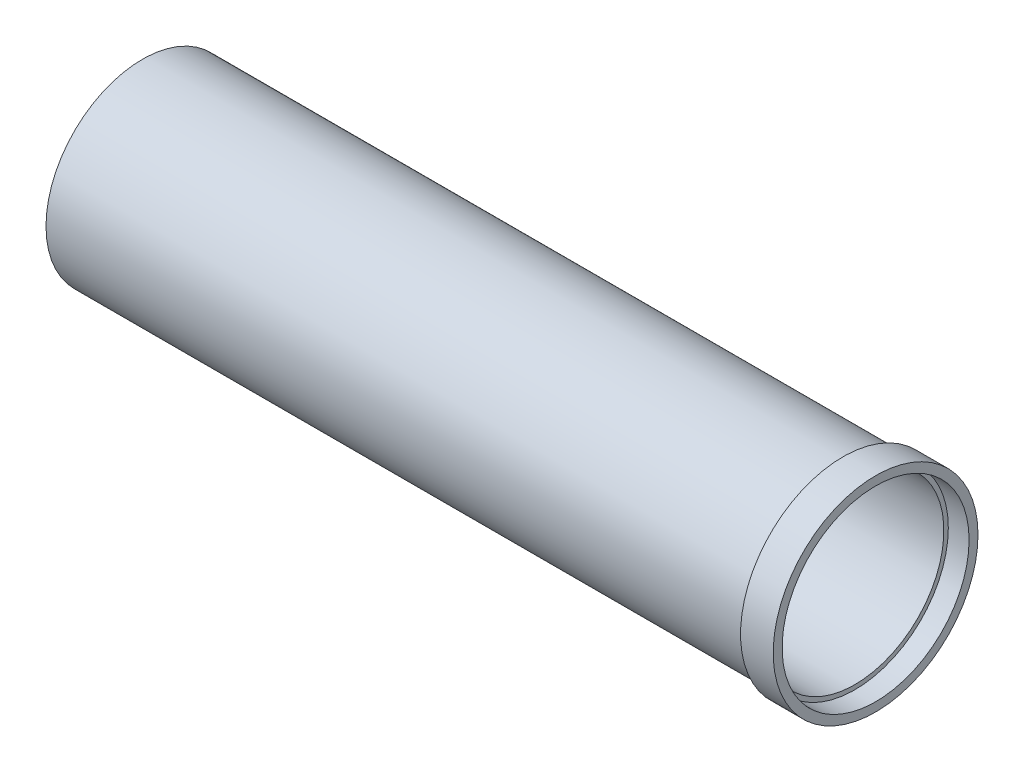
from build123d import *

# Parameters (mm, degrees)
SKETCH1_R           = 41.275
SKETCH1_R_2         = 38.1
EXTRUDE_THIN1_DEPTH = 152.4
EXTRUDE2_DEPTH      = 8.89
EXTRUDE2_DEPTH_BACK = 5.08
SKETCH2_R           = 43.815
SKETCH2_R_2         = 40.005


with BuildPart() as part:
    # Sketch1 → Extrude-Thin1 (new, symmetric)
    with BuildSketch(Plane(origin=(0, 0, 0), x_dir=(0, 0, -1), z_dir=(1, 0, 0))):
        Circle(SKETCH1_R)
        Circle(SKETCH1_R_2, mode=Mode.SUBTRACT)
    extrude(amount=EXTRUDE_THIN1_DEPTH, both=True)

    # Sketch2 → Extrude2 (add, two sides: drawn at the far end of the back side and taken through both)
    with BuildSketch(Plane(origin=(152.4, 0, 0), x_dir=(0, 0, -1), z_dir=(1, 0, 0)).offset(-EXTRUDE2_DEPTH_BACK)):
        Circle(SKETCH2_R)
        Circle(SKETCH2_R_2, mode=Mode.SUBTRACT)
    extrude(amount=EXTRUDE2_DEPTH + EXTRUDE2_DEPTH_BACK)


solid = part.part
